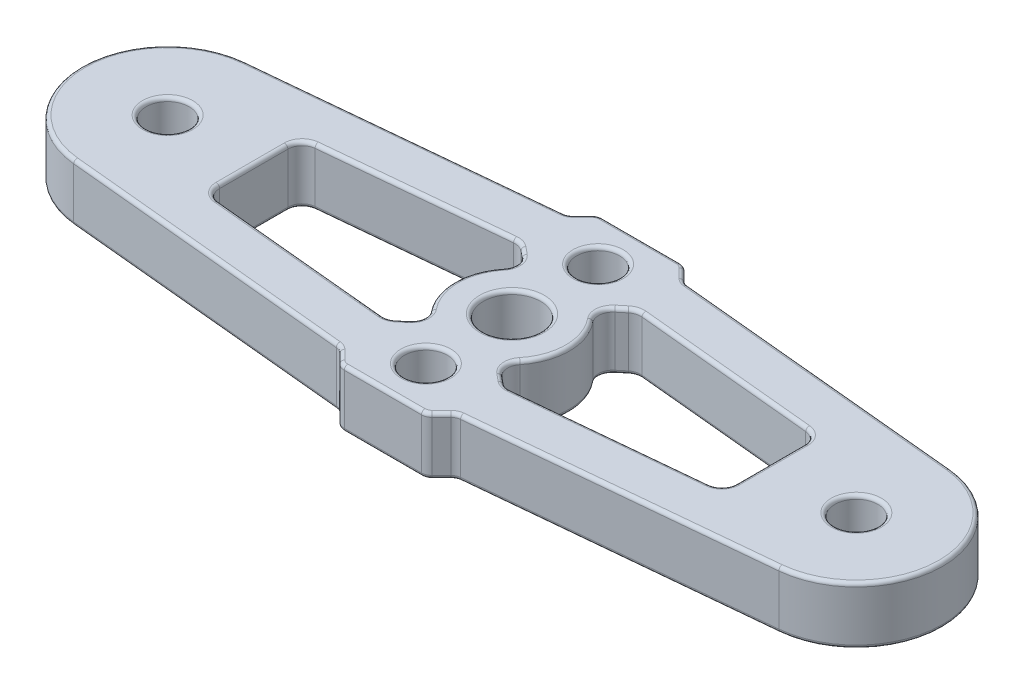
from build123d import *

# Parameters (mm, degrees)
SKIZZE1_R                       = 2
SKIZZE1_R_2                     = 1.5
AUFSATZ_LINEAR_AUSTRAGEN1_DEPTH = 4
VERRUNDUNG1_R                   = 1
VERRUNDUNG2_R                   = 0.75
VERRUNDUNG3_R                   = 0.25


with BuildPart() as part:
    # Skizze1 → Aufsatz-Linear austragen1 (new body)
    with BuildSketch(Plane(origin=(0, 0, 0), x_dir=(1, 0, 0), z_dir=(0, 1, 0))):
        with BuildLine():
            Line((21, 9), (27, 9))
            Line((27, 9), (28.060660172, 7.939339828))
            Line((28.060660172, 7.939339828), (48.572665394, 5.972608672))
            ThreePointArc((48.572665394, 5.972608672), (54, 0), (48.572665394, -5.972608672))
            Line((48.572665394, -5.972608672), (28.060660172, -7.939339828))
            Line((28.060660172, -7.939339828), (27, -9))
            Line((27, -9), (21, -9))
            Line((21, -9), (19.939339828, -7.939339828))
            Line((19.939339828, -7.939339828), (-0.572665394, -5.972608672))
            ThreePointArc((-0.572665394, -5.972608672), (-6, 0), (-0.572665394, 5.972608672))
            Line((-0.572665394, 5.972608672), (19.939339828, 7.939339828))
            Line((19.939339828, 7.939339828), (21, 9))
        make_face()
        with Locations(Location((24, 0, 0), (0, 0, 270))):
            Circle(SKIZZE1_R, mode=Mode.SUBTRACT)
        with Locations(Location((24, 6, 0), (0, 0, 270))):
            Circle(SKIZZE1_R_2, mode=Mode.SUBTRACT)
        with Locations(Location((24, -6, 0), (0, 0, 270))):
            Circle(SKIZZE1_R_2, mode=Mode.SUBTRACT)
        with Locations(Location((0, 0, 0), (0, 0, 270))):
            Circle(SKIZZE1_R_2, mode=Mode.SUBTRACT)
        with Locations(Location((48, 0, 0), (0, 0, 90))):
            Circle(SKIZZE1_R_2, mode=Mode.SUBTRACT)
        with BuildLine():
            Line((6, -3.287674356), (6, 3.287674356))
            Line((6, 3.287674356), (19.936086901, 4.623893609))
            Line((19.936086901, 4.623893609), (21.632634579, 3.224217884))
            ThreePointArc((21.632634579, 3.224217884), (20, 0), (21.632634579, -3.224217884))
            Line((21.632634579, -3.224217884), (19.936086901, -4.623893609))
            Line((19.936086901, -4.623893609), (6, -3.287674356))
        make_face(mode=Mode.SUBTRACT)
        with BuildLine():
            Line((28.063913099, -4.623893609), (26.367365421, -3.224217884))
            ThreePointArc((26.367365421, -3.224217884), (28, 0), (26.367365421, 3.224217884))
            Line((26.367365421, 3.224217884), (28.063913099, 4.623893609))
            Line((28.063913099, 4.623893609), (42, 3.287674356))
            Line((42, 3.287674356), (42, -3.287674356))
            Line((42, -3.287674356), (28.063913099, -4.623893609))
        make_face(mode=Mode.SUBTRACT)
    extrude(amount=AUFSATZ_LINEAR_AUSTRAGEN1_DEPTH)

    # Verrundung1
    verrundung1_edges = [part.edges().sort_by_distance(p)[0] for p in [
        (28.063913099, 2, 4.623893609),
        (42, 2, 3.287674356),
        (42, 2, -3.287674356),
        (28.063913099, 2, -4.623893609),
        (26.367365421, 2, -3.224217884),
        (26.367365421, 2, 3.224217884),
        (19.936086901, 2, -4.623893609),
        (6, 2, -3.287674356),
        (6, 2, 3.287674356),
        (19.936086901, 2, 4.623893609),
        (21.632634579, 2, 3.224217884),
        (21.632634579, 2, -3.224217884),
    ]]
    fillet(verrundung1_edges, radius=VERRUNDUNG1_R)

    # Verrundung2
    verrundung2_edges = [part.edges().sort_by_distance(p)[0] for p in [
        (21, 2, -9),
        (27, 2, -9),
        (28.060660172, 2, -7.939339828),
        (28.060660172, 2, 7.939339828),
        (27, 2, 9),
        (21, 2, 9),
        (19.939339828, 2, 7.939339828),
        (19.939339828, 2, -7.939339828),
    ]]
    fillet(verrundung2_edges, radius=VERRUNDUNG2_R)

    # Verrundung3
    verrundung3_edges = [part.edges().sort_by_distance(p)[0] for p in [
        (-6, 4, 0),
        (13.214160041, 0, 3.979382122),
        (13.214160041, 4, 3.979382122),
        (20.511381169, 0, 4.149267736),
        (20.511381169, 4, 4.149267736),
        (20, 0, 0),
        (20, 4, 0),
        (20.511381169, 0, -4.149267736),
        (20.511381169, 4, -4.149267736),
        (13.214160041, 0, -3.979382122),
        (13.214160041, 4, -3.979382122),
        (42, 0, 0),
        (42, 4, 0),
        (34.785839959, 0, -3.979382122),
        (34.785839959, 4, -3.979382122),
        (38.450771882, 0, -6.943115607),
        (27.488618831, 0, -4.149267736),
        (27.488618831, 4, -4.149267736),
        (28, 0, 0),
        (28, 4, 0),
        (54, 0, 0),
        (27.488618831, 0, 4.149267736),
        (27.488618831, 4, 4.149267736),
        (34.785839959, 0, 3.979382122),
        (34.785839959, 4, 3.979382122),
        (6.259917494, 0, 3.051486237),
        (6.259917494, 4, 3.051486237),
        (19.911965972, 0, 4.545111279),
        (19.911965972, 4, 4.545111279),
        (21.126021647, 0, 3.264260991),
        (21.126021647, 4, 3.264260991),
        (9.549228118, 4, 6.943115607),
        (21.126021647, 0, -3.264260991),
        (21.126021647, 4, -3.264260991),
        (19.911965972, 0, -4.545111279),
        (19.911965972, 4, -4.545111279),
        (41.740082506, 0, -3.051486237),
        (41.740082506, 4, -3.051486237),
        (28.088034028, 0, -4.545111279),
        (28.088034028, 4, -4.545111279),
        (26.873978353, 0, -3.264260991),
        (26.873978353, 4, -3.264260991),
        (26.873978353, 0, 3.264260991),
        (26.873978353, 4, 3.264260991),
        (28.088034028, 0, 4.545111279),
        (28.088034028, 4, 4.545111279),
        (41.740082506, 0, 3.051486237),
        (41.740082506, 4, 3.051486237),
        (6.259917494, 0, -3.051486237),
        (6.259917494, 4, -3.051486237),
        (9.549228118, 0, 6.943115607),
        (-6, 0, 0),
        (20.455099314, 0, -8.455099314),
        (20.455099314, 4, -8.455099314),
        (24, 0, -9),
        (27.544900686, 0, -8.455099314),
        (38.450771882, 0, 6.943115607),
        (27.544900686, 0, 8.455099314),
        (24, 0, 9),
        (20.455099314, 0, 8.455099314),
        (9.549228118, 0, -6.943115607),
        (21.023647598, 0, 8.942909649),
        (26.976352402, 0, 8.942909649),
        (26.976352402, 0, -8.942909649),
        (21.023647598, 0, -8.942909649),
        (24, 4, -9),
        (9.549228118, 4, -6.943115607),
        (20.455099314, 4, 8.455099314),
        (24, 4, 9),
        (27.544900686, 4, 8.455099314),
        (38.450771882, 4, 6.943115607),
        (27.544900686, 4, -8.455099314),
        (21.023647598, 4, 8.942909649),
        (26.976352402, 4, 8.942909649),
        (26.976352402, 4, -8.942909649),
        (21.023647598, 4, -8.942909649),
        (28.080671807, 0, -7.981792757),
        (28.080671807, 4, -7.981792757),
        (28.080671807, 0, 7.981792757),
        (28.080671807, 4, 7.981792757),
        (19.919328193, 0, -7.981792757),
        (19.919328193, 4, -7.981792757),
        (19.919328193, 0, 7.981792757),
        (19.919328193, 4, 7.981792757),
        (54, 4, 0),
        (0, 0, -1.5),
        (0, 4, -1.5),
        (38.450771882, 4, -6.943115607),
        (24, 0, -2),
        (24, 4, -2),
        (48, 0, 1.5),
        (48, 4, 1.5),
        (24, 0, -7.5),
        (24, 4, -7.5),
        (24, 0, 4.5),
        (24, 4, 4.5),
        (6, 0, 0),
        (6, 4, 0),
    ]]
    fillet(verrundung3_edges, radius=VERRUNDUNG3_R)


solid = part.part
